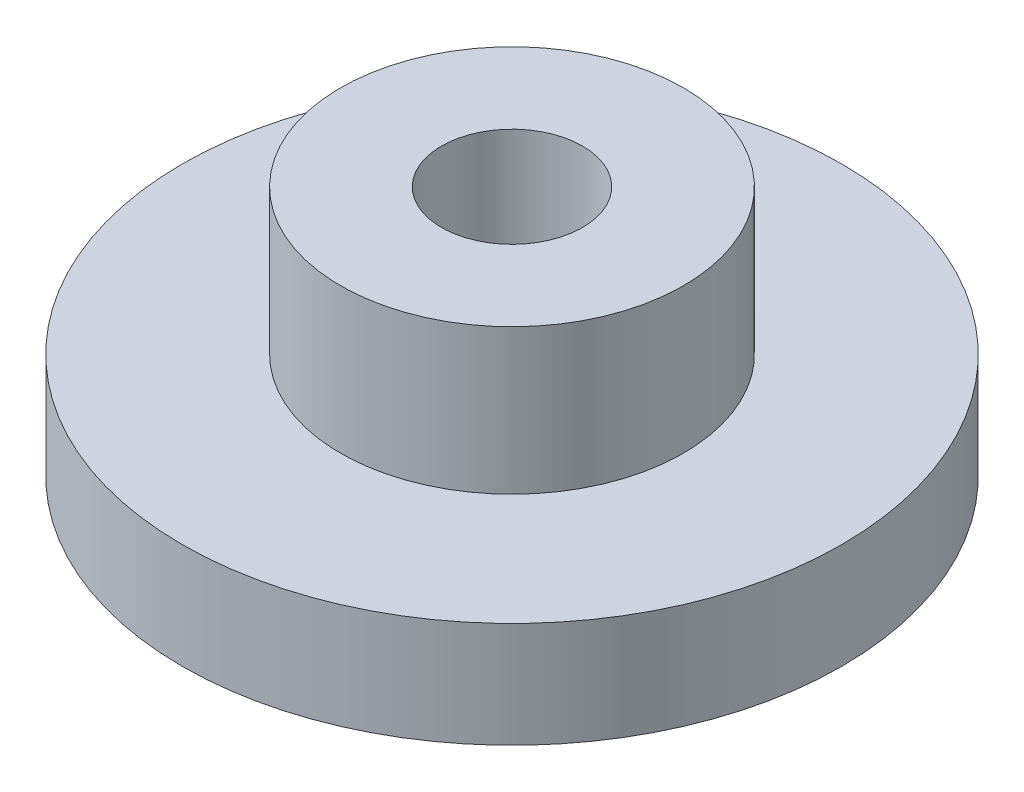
from build123d import *

# Parameters (mm, degrees)
CHAMFER_1_SIZE = 3


with BuildPart() as part:
    # Sketch 1 → Revolve 1 (revolve)
    with BuildSketch(Plane.XY, mode=Mode.PRIVATE) as revolve_1_sk:
        Polygon((2.675, 0), (6.5, 0), (6.5, -5.5), (12.5, -5.5), (12.5, -9.5), (2.675, -9.5), align=None)
    revolve(revolve_1_sk.sketch.rotate(Axis((0, 0, 0), (0, 1, 0)), 90), axis=Axis((0, 0, 0), (0, 1, 0)))

    # Chamfer 1
    chamfer_1_edges = [part.edges().sort_by_distance(p)[0] for p in [
        (0, -9.5, 2.675),
    ]]
    chamfer(chamfer_1_edges, length=CHAMFER_1_SIZE)


solid = part.part
